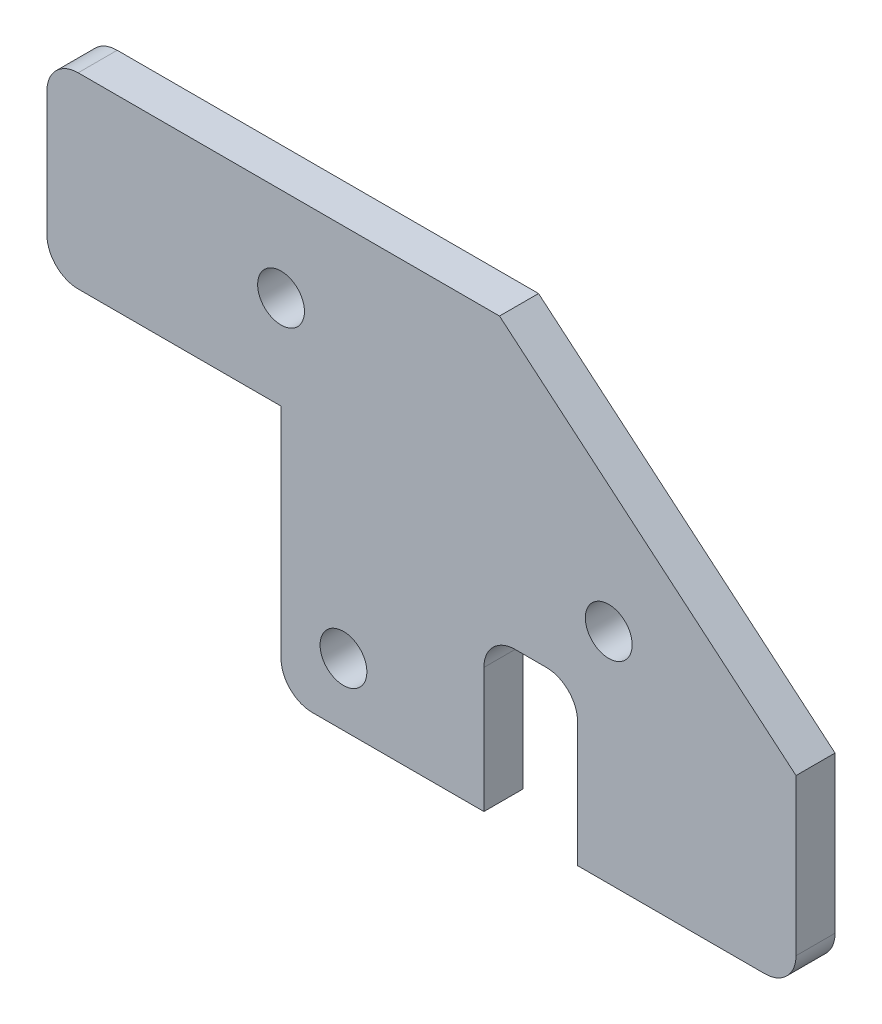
from build123d import *

# Parameters (mm, degrees)
ESQUISSE1_R            = 1.5
BASE_PRISMATIQUE_DEPTH = 2.5
CONG_S_R2_R            = 2


with BuildPart() as part:
    # Esquisse1 → Base prismatique (new body)
    with BuildSketch(Plane.XY):
        Polygon((-15, 6), (14, 6), (33, -10), (33, -22), (19, -22), (19, -12), (13, -12), (13, -22), (0, -22), (0, -6), (-15, -6), align=None)
        Circle(ESQUISSE1_R, mode=Mode.SUBTRACT)
        with Locations((4, -18)):
            Circle(ESQUISSE1_R, mode=Mode.SUBTRACT)
        with Locations((21, -8)):
            Circle(ESQUISSE1_R, mode=Mode.SUBTRACT)
    extrude(amount=BASE_PRISMATIQUE_DEPTH)

    # Cong_s R2
    cong_s_r2_edges = [part.edges().sort_by_distance(p)[0] for p in [
        (-15, 6, 1.25),
        (33, -22, 1.25),
        (19, -12, 1.25),
        (13, -12, 1.25),
        (0, -22, 1.25),
        (-15, -6, 1.25),
    ]]
    fillet(cong_s_r2_edges, radius=CONG_S_R2_R)


solid = part.part
